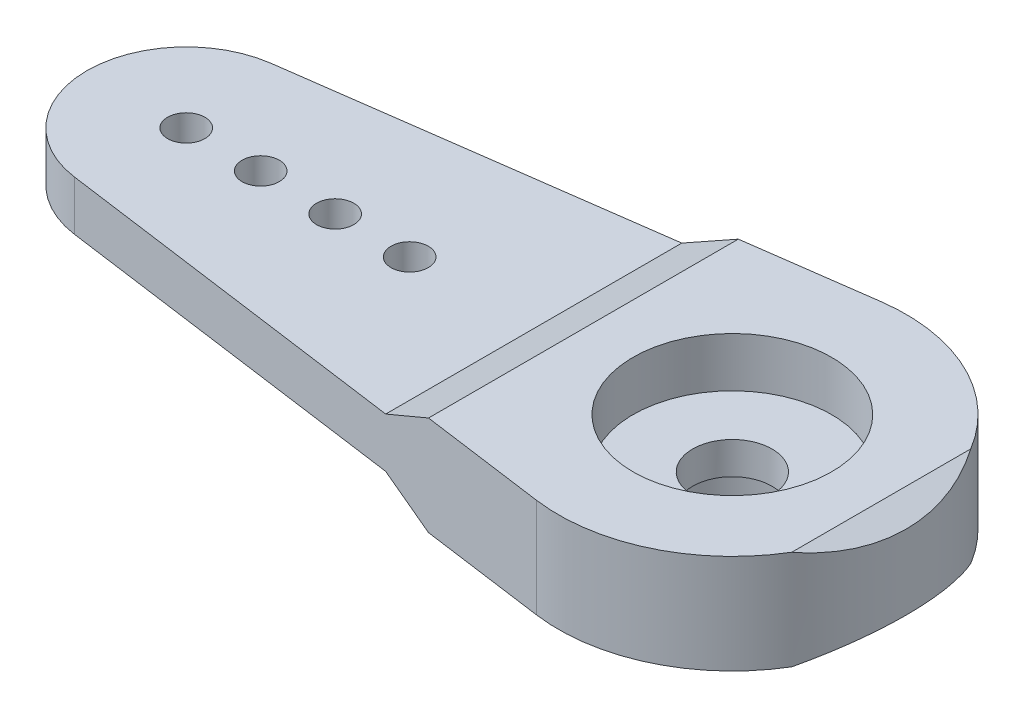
from build123d import *

# Parameters (mm, degrees)
EXTRUSION6_DEPTH        = 30
ESQUISSE8_W             = 60
ESQUISSE8_H             = 30
ENL_V_MAT_EXTRU_4_DEPTH = 43.614551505
ESQUISSE9_R             = 4
ENL_V_MAT_EXTRU_5_DEPTH = 2
ESQUISSE10_R            = 5
EXTRUSION7_DEPTH        = 0.5
ESQUISSE11_R            = 5
EXTRUSION8_DEPTH        = 1.5
EXTRUSION8_TAPER        = 45
ESQUISSE12_R            = 0.75
ENL_V_MAT_EXTRU_6_DEPTH = 35.423828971
ESQUISSE13_R            = 2.9
EXTRUSION9_DEPTH        = 2.7
ESQUISSE14_R            = 1.6
ENL_V_MAT_EXTRU_7_DEPTH = 35.292856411


with BuildPart() as part:
    # Esquisse1 → Extrusion6 (new body)
    with BuildSketch(Plane.XY):
        Polygon((-30, 3), (-8, 3), (-6, 4), (6, 4), (8, 3), (30, 3), (30, 1), (8, 1), (6, 0), (-6, 0), (-8, 1), (-30, 1), align=None)
    extrude(amount=EXTRUSION6_DEPTH)

    # Esquisse8 → Enl_v. mat.-Extru.4 (cut, through all)
    with BuildSketch(Plane(origin=(0, 4, 0), x_dir=(1, 0, 0), z_dir=(0, 1, 0))):
        with Locations((0, -15)):
            Rectangle(ESQUISSE8_W, ESQUISSE8_H)
        with BuildLine():
            Line((-22.545454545, -11.037364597), (-0.954545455, -8.065388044))
            ThreePointArc((-0.954545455, -8.065388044), (7, -15), (-0.954545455, -21.934611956))
            Line((-0.954545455, -21.934611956), (-22.545454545, -18.962635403))
            ThreePointArc((-22.545454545, -18.962635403), (-26, -15), (-22.545454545, -11.037364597))
        make_face(mode=Mode.SUBTRACT)
    extrude(amount=-ENL_V_MAT_EXTRU_4_DEPTH, mode=Mode.SUBTRACT)

    # Esquisse9 → Enl_v. mat.-Extru.5 (cut)
    with BuildSketch(Plane(origin=(0, 4, 0), x_dir=(1, 0, 0), z_dir=(0, 1, 0))):
        with Locations(Location((0, -15, 0), (0, 0, 270))):
            Circle(ESQUISSE9_R)
    extrude(amount=-ENL_V_MAT_EXTRU_5_DEPTH, mode=Mode.SUBTRACT)

    # Esquisse10 → Extrusion7 (add)
    with BuildSketch(Plane.XZ):
        with Locations(Location((0, 15, 0), (0, 0, 90))):
            Circle(ESQUISSE10_R)
    extrude(amount=EXTRUSION7_DEPTH)

    # Esquisse11 → Extrusion8 (add)
    with BuildSketch(Plane.XZ.offset(0.5)):
        with Locations(Location((0, 15, 0), (0, 0, 90))):
            Circle(ESQUISSE11_R)
    extrude(amount=EXTRUSION8_DEPTH, taper=EXTRUSION8_TAPER)

    # Esquisse12 → Enl_v. mat.-Extru.6 (cut, through all)
    with BuildSketch(Plane(origin=(0, 3, 0), x_dir=(1, 0, 0), z_dir=(0, 1, 0))):
        with Locations(Location((-13, -15, 0), (0, 0, 270))):
            Circle(ESQUISSE12_R)
        with Locations(Location((-16, -15, 0), (0, 0, 270))):
            Circle(ESQUISSE12_R)
        with Locations(Location((-19, -15, 0), (0, 0, 270))):
            Circle(ESQUISSE12_R)
        with Locations(Location((-22, -15, 0), (0, 0, 270))):
            Circle(ESQUISSE12_R)
    extrude(amount=-ENL_V_MAT_EXTRU_6_DEPTH, mode=Mode.SUBTRACT)

    # Esquisse13 → Extrusion9 (cut)
    with BuildSketch(Plane.XZ.offset(2)):
        with Locations(Location((0, 15, 0), (0, 0, 270))):
            Circle(ESQUISSE13_R)
    extrude(amount=-EXTRUSION9_DEPTH, mode=Mode.SUBTRACT)

    # Esquisse14 → Enl_v. mat.-Extru.7 (cut, through all)
    with BuildSketch(Plane(origin=(0, 2, 0), x_dir=(1, 0, 0), z_dir=(0, 1, 0))):
        with Locations(Location((0, -15, 0), (0, 0, 270))):
            Circle(ESQUISSE14_R)
    extrude(amount=-ENL_V_MAT_EXTRU_7_DEPTH, mode=Mode.SUBTRACT)


solid = part.part
